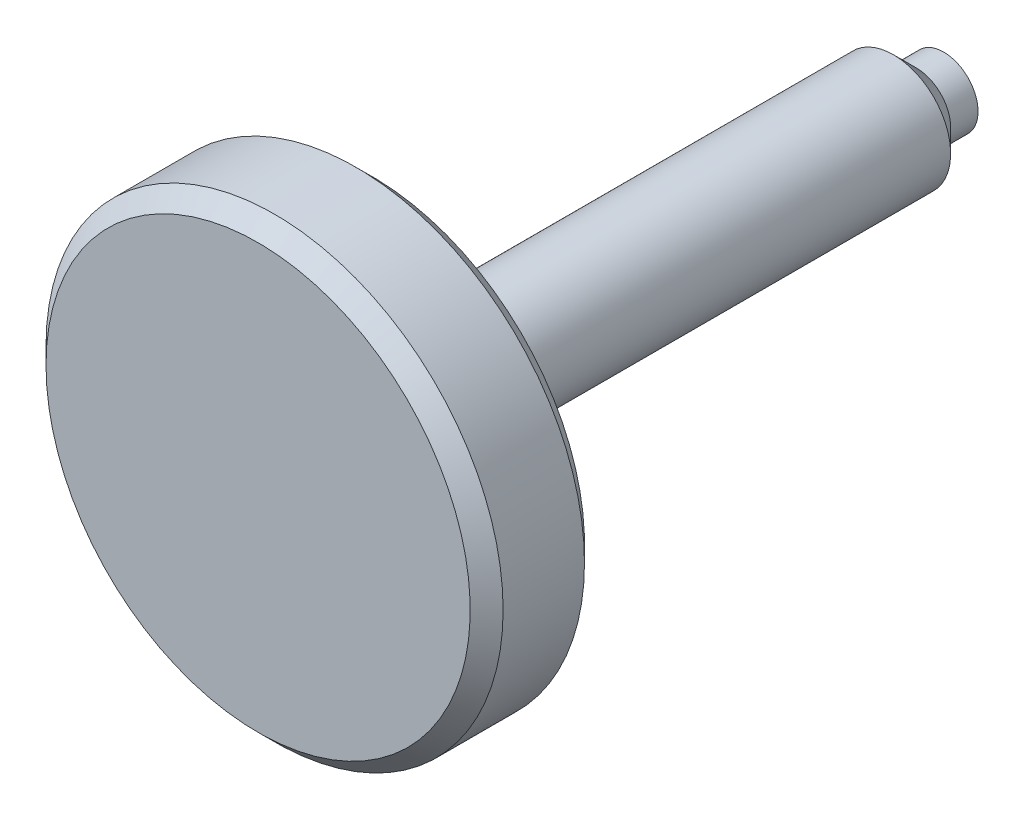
ISO-10303-21;
HEADER;
FILE_DESCRIPTION(('STEP AP214'),'2;1');
FILE_NAME('part.step','',(''),(''),'','','');
FILE_SCHEMA(('AUTOMOTIVE_DESIGN { 1 0 10303 214 1 1 1 1 }'));
ENDSEC;
DATA;
#1=APPLICATION_CONTEXT('core data for automotive mechanical design processes');
#2=APPLICATION_PROTOCOL_DEFINITION('international standard','automotive_design',2000,#1);
#3=PRODUCT_CONTEXT('',#1,'mechanical');
#4=PRODUCT('Part','Part','',(#3));
#5=PRODUCT_RELATED_PRODUCT_CATEGORY('part','',(#4));
#6=PRODUCT_DEFINITION_FORMATION('','',#4);
#7=PRODUCT_DEFINITION_CONTEXT('part definition',#1,'design');
#8=PRODUCT_DEFINITION('design','',#6,#7);
#9=PRODUCT_DEFINITION_SHAPE('','',#8);
#10=(LENGTH_UNIT() NAMED_UNIT(*) SI_UNIT(.MILLI.,.METRE.));
#11=(NAMED_UNIT(*) PLANE_ANGLE_UNIT() SI_UNIT($,.RADIAN.));
#12=(NAMED_UNIT(*) SI_UNIT($,.STERADIAN.) SOLID_ANGLE_UNIT());
#13=UNCERTAINTY_MEASURE_WITH_UNIT(LENGTH_MEASURE(1.E-05),#10,'distance_accuracy_value','');
#14=(GEOMETRIC_REPRESENTATION_CONTEXT(3) GLOBAL_UNCERTAINTY_ASSIGNED_CONTEXT((#13)) GLOBAL_UNIT_ASSIGNED_CONTEXT((#10,
#11,#12)) REPRESENTATION_CONTEXT('',''));
#15=CARTESIAN_POINT('',(0.,0.,0.));
#16=DIRECTION('',(0.,0.,1.));
#17=DIRECTION('',(1.,0.,0.));
#18=AXIS2_PLACEMENT_3D('',#15,#16,#17);
#19=CARTESIAN_POINT('',(0.,-1.5,0.));
#20=DIRECTION('',(0.,0.,-1.));
#21=DIRECTION('',(1.,0.,0.));
#22=AXIS2_PLACEMENT_3D('',#19,#20,#21);
#23=PLANE('',#22);
#24=CARTESIAN_POINT('',(0.,0.,0.));
#25=DIRECTION('',(0.,0.,1.));
#26=DIRECTION('',(-1.,0.,0.));
#27=AXIS2_PLACEMENT_3D('',#24,#25,#26);
#28=CIRCLE('',#27,1.5);
#29=CARTESIAN_POINT('',(-1.5,0.,0.));
#30=VERTEX_POINT('',#29);
#31=EDGE_CURVE('E8',#30,#30,#28,.T.);
#32=ORIENTED_EDGE('',*,*,#31,.F.);
#33=EDGE_LOOP('',(#32));
#34=FACE_BOUND('',#33,.T.);
#35=ADVANCED_FACE('F13',(#34),#23,.T.);
#36=CARTESIAN_POINT('',(0.,0.,41.4535294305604));
#37=DIRECTION('',(0.,0.,1.));
#38=DIRECTION('',(-1.,0.,0.));
#39=AXIS2_PLACEMENT_3D('',#36,#37,#38);
#40=CYLINDRICAL_SURFACE('',#39,1.5);
#41=ORIENTED_EDGE('',*,*,#31,.T.);
#42=EDGE_LOOP('',(#41));
#43=FACE_BOUND('',#42,.T.);
#44=CARTESIAN_POINT('',(0.,0.,1.2));
#45=DIRECTION('',(0.,0.,1.));
#46=DIRECTION('',(-1.,0.,0.));
#47=AXIS2_PLACEMENT_3D('',#44,#45,#46);
#48=CIRCLE('',#47,1.5);
#49=CARTESIAN_POINT('',(-1.5,0.,1.2));
#50=VERTEX_POINT('',#49);
#51=EDGE_CURVE('E21',#50,#50,#48,.T.);
#52=ORIENTED_EDGE('',*,*,#51,.F.);
#53=EDGE_LOOP('',(#52));
#54=FACE_BOUND('',#53,.T.);
#55=ADVANCED_FACE('F150',(#43,#54),#40,.T.);
#56=CARTESIAN_POINT('',(0.,0.,2.20000000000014));
#57=DIRECTION('',(0.,0.,1.));
#58=DIRECTION('',(-1.,0.,0.));
#59=AXIS2_PLACEMENT_3D('',#56,#57,#58);
#60=CONICAL_SURFACE('',#59,2.49999999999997,0.785398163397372);
#61=ORIENTED_EDGE('',*,*,#51,.T.);
#62=EDGE_LOOP('',(#61));
#63=FACE_BOUND('',#62,.T.);
#64=CARTESIAN_POINT('',(0.,0.,2.20000000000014));
#65=DIRECTION('',(0.,0.,1.));
#66=DIRECTION('',(-1.,0.,0.));
#67=AXIS2_PLACEMENT_3D('',#64,#65,#66);
#68=CIRCLE('',#67,2.49999999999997);
#69=CARTESIAN_POINT('',(-2.49999999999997,0.,2.20000000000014));
#70=VERTEX_POINT('',#69);
#71=EDGE_CURVE('E25',#70,#70,#68,.T.);
#72=ORIENTED_EDGE('',*,*,#71,.F.);
#73=EDGE_LOOP('',(#72));
#74=FACE_BOUND('',#73,.T.);
#75=ADVANCED_FACE('F146',(#63,#74),#60,.T.);
#76=CARTESIAN_POINT('',(0.,0.,41.4535294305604));
#77=DIRECTION('',(0.,0.,1.));
#78=DIRECTION('',(-1.,0.,0.));
#79=AXIS2_PLACEMENT_3D('',#76,#77,#78);
#80=CYLINDRICAL_SURFACE('',#79,2.5);
#81=ORIENTED_EDGE('',*,*,#71,.T.);
#82=EDGE_LOOP('',(#81));
#83=FACE_BOUND('',#82,.T.);
#84=CARTESIAN_POINT('',(0.,0.,25.));
#85=DIRECTION('',(0.,0.,1.));
#86=DIRECTION('',(-1.,0.,0.));
#87=AXIS2_PLACEMENT_3D('',#84,#85,#86);
#88=CIRCLE('',#87,2.5);
#89=CARTESIAN_POINT('',(-2.5,0.,25.));
#90=VERTEX_POINT('',#89);
#91=EDGE_CURVE('E29',#90,#90,#88,.T.);
#92=ORIENTED_EDGE('',*,*,#91,.F.);
#93=EDGE_LOOP('',(#92));
#94=FACE_BOUND('',#93,.T.);
#95=ADVANCED_FACE('F142',(#83,#94),#80,.T.);
#96=CARTESIAN_POINT('',(0.,-9.28,25.));
#97=DIRECTION('',(0.,0.,-1.));
#98=DIRECTION('',(1.,0.,0.));
#99=AXIS2_PLACEMENT_3D('',#96,#97,#98);
#100=PLANE('',#99);
#101=ORIENTED_EDGE('',*,*,#91,.T.);
#102=EDGE_LOOP('',(#101));
#103=FACE_BOUND('',#102,.T.);
#104=CARTESIAN_POINT('',(0.,0.,25.));
#105=DIRECTION('',(0.,0.,1.));
#106=DIRECTION('',(-1.,0.,0.));
#107=AXIS2_PLACEMENT_3D('',#104,#105,#106);
#108=CIRCLE('',#107,9.28);
#109=CARTESIAN_POINT('',(-9.28,0.,25.));
#110=VERTEX_POINT('',#109);
#111=EDGE_CURVE('E34',#110,#110,#108,.T.);
#112=ORIENTED_EDGE('',*,*,#111,.F.);
#113=EDGE_LOOP('',(#112));
#114=FACE_BOUND('',#113,.T.);
#115=ADVANCED_FACE('F138',(#103,#114),#100,.T.);
#116=CARTESIAN_POINT('',(0.,0.,25.72));
#117=DIRECTION('',(0.,0.,1.));
#118=DIRECTION('',(-1.,0.,0.));
#119=AXIS2_PLACEMENT_3D('',#116,#117,#118);
#120=CONICAL_SURFACE('',#119,10.,0.785398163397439);
#121=ORIENTED_EDGE('',*,*,#111,.T.);
#122=EDGE_LOOP('',(#121));
#123=FACE_BOUND('',#122,.T.);
#124=CARTESIAN_POINT('',(0.,0.,25.72));
#125=DIRECTION('',(0.,0.,1.));
#126=DIRECTION('',(-1.,0.,0.));
#127=AXIS2_PLACEMENT_3D('',#124,#125,#126);
#128=CIRCLE('',#127,10.);
#129=CARTESIAN_POINT('',(-10.,0.,25.72));
#130=VERTEX_POINT('',#129);
#131=EDGE_CURVE('E37',#130,#130,#128,.T.);
#132=ORIENTED_EDGE('',*,*,#131,.F.);
#133=EDGE_LOOP('',(#132));
#134=FACE_BOUND('',#133,.T.);
#135=ADVANCED_FACE('F134',(#123,#134),#120,.T.);
#136=CARTESIAN_POINT('',(0.,0.,41.4535294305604));
#137=DIRECTION('',(0.,0.,1.));
#138=DIRECTION('',(-1.,0.,0.));
#139=AXIS2_PLACEMENT_3D('',#136,#137,#138);
#140=CYLINDRICAL_SURFACE('',#139,10.);
#141=ORIENTED_EDGE('',*,*,#131,.T.);
#142=EDGE_LOOP('',(#141));
#143=FACE_BOUND('',#142,.T.);
#144=CARTESIAN_POINT('',(0.,0.,29.28));
#145=DIRECTION('',(0.,0.,1.));
#146=DIRECTION('',(-1.,0.,0.));
#147=AXIS2_PLACEMENT_3D('',#144,#145,#146);
#148=CIRCLE('',#147,10.);
#149=CARTESIAN_POINT('',(-10.,0.,29.28));
#150=VERTEX_POINT('',#149);
#151=EDGE_CURVE('E40',#150,#150,#148,.T.);
#152=ORIENTED_EDGE('',*,*,#151,.F.);
#153=EDGE_LOOP('',(#152));
#154=FACE_BOUND('',#153,.T.);
#155=ADVANCED_FACE('F130',(#143,#154),#140,.T.);
#156=CARTESIAN_POINT('',(0.,0.,30.));
#157=DIRECTION('',(0.,0.,-1.));
#158=DIRECTION('',(1.,0.,0.));
#159=AXIS2_PLACEMENT_3D('',#156,#157,#158);
#160=CONICAL_SURFACE('',#159,9.28,0.785398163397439);
#161=ORIENTED_EDGE('',*,*,#151,.T.);
#162=EDGE_LOOP('',(#161));
#163=FACE_BOUND('',#162,.T.);
#164=CARTESIAN_POINT('',(0.,0.,30.));
#165=DIRECTION('',(0.,0.,1.));
#166=DIRECTION('',(-1.,0.,0.));
#167=AXIS2_PLACEMENT_3D('',#164,#165,#166);
#168=CIRCLE('',#167,9.28);
#169=CARTESIAN_POINT('',(-9.28,0.,30.));
#170=VERTEX_POINT('',#169);
#171=EDGE_CURVE('E43',#170,#170,#168,.T.);
#172=ORIENTED_EDGE('',*,*,#171,.F.);
#173=EDGE_LOOP('',(#172));
#174=FACE_BOUND('',#173,.T.);
#175=ADVANCED_FACE('F126',(#163,#174),#160,.T.);
#176=CARTESIAN_POINT('',(0.,0.,30.));
#177=DIRECTION('',(0.,0.,1.));
#178=DIRECTION('',(-1.,0.,0.));
#179=AXIS2_PLACEMENT_3D('',#176,#177,#178);
#180=PLANE('',#179);
#181=ORIENTED_EDGE('',*,*,#171,.T.);
#182=EDGE_LOOP('',(#181));
#183=FACE_BOUND('',#182,.T.);
#184=ADVANCED_FACE('F123',(#183),#180,.T.);
#185=CLOSED_SHELL('',(#35,#55,#75,#95,#115,#135,#155,#175,#184));
#186=CARTESIAN_POINT('',(0.,-1.5,1.));
#187=DIRECTION('',(0.,0.,-1.));
#188=DIRECTION('',(1.,0.,0.));
#189=AXIS2_PLACEMENT_3D('',#186,#187,#188);
#190=PLANE('',#189);
#191=CARTESIAN_POINT('',(0.,0.,1.));
#192=DIRECTION('',(0.,0.,1.));
#193=DIRECTION('',(-1.,0.,0.));
#194=AXIS2_PLACEMENT_3D('',#191,#192,#193);
#195=CIRCLE('',#194,0.5);
#196=CARTESIAN_POINT('',(-0.5,0.,1.));
#197=VERTEX_POINT('',#196);
#198=EDGE_CURVE('E67',#197,#197,#195,.T.);
#199=ORIENTED_EDGE('',*,*,#198,.T.);
#200=EDGE_LOOP('',(#199));
#201=FACE_BOUND('',#200,.T.);
#202=ADVANCED_FACE('F15',(#201),#190,.F.);
#203=CARTESIAN_POINT('',(0.,0.,29.));
#204=DIRECTION('',(0.,0.,1.));
#205=DIRECTION('',(-1.,0.,0.));
#206=AXIS2_PLACEMENT_3D('',#203,#204,#205);
#207=PLANE('',#206);
#208=CARTESIAN_POINT('',(0.,0.,29.));
#209=DIRECTION('',(0.,0.,1.));
#210=DIRECTION('',(-1.,0.,0.));
#211=AXIS2_PLACEMENT_3D('',#208,#209,#210);
#212=CIRCLE('',#211,8.86578643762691);
#213=CARTESIAN_POINT('',(-8.86578643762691,0.,29.));
#214=VERTEX_POINT('',#213);
#215=EDGE_CURVE('E46',#214,#214,#212,.T.);
#216=ORIENTED_EDGE('',*,*,#215,.F.);
#217=EDGE_LOOP('',(#216));
#218=FACE_BOUND('',#217,.T.);
#219=ADVANCED_FACE('F112',(#218),#207,.F.);
#220=CARTESIAN_POINT('',(0.,0.,29.));
#221=DIRECTION('',(0.,0.,-1.));
#222=DIRECTION('',(1.,0.,0.));
#223=AXIS2_PLACEMENT_3D('',#220,#221,#222);
#224=CONICAL_SURFACE('',#223,8.86578643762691,0.785398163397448);
#225=CARTESIAN_POINT('',(0.,0.,28.8657864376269));
#226=DIRECTION('',(0.,0.,1.));
#227=DIRECTION('',(-1.,0.,0.));
#228=AXIS2_PLACEMENT_3D('',#225,#226,#227);
#229=CIRCLE('',#228,9.);
#230=CARTESIAN_POINT('',(-9.,0.,28.8657864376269));
#231=VERTEX_POINT('',#230);
#232=EDGE_CURVE('E49',#231,#231,#229,.T.);
#233=ORIENTED_EDGE('',*,*,#232,.F.);
#234=EDGE_LOOP('',(#233));
#235=FACE_BOUND('',#234,.T.);
#236=ORIENTED_EDGE('',*,*,#215,.T.);
#237=EDGE_LOOP('',(#236));
#238=FACE_BOUND('',#237,.T.);
#239=ADVANCED_FACE('F106',(#235,#238),#224,.F.);
#240=CARTESIAN_POINT('',(0.,0.,41.4535294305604));
#241=DIRECTION('',(0.,0.,1.));
#242=DIRECTION('',(-1.,0.,0.));
#243=AXIS2_PLACEMENT_3D('',#240,#241,#242);
#244=CYLINDRICAL_SURFACE('',#243,9.);
#245=CARTESIAN_POINT('',(0.,0.,26.1342135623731));
#246=DIRECTION('',(0.,0.,1.));
#247=DIRECTION('',(-1.,0.,0.));
#248=AXIS2_PLACEMENT_3D('',#245,#246,#247);
#249=CIRCLE('',#248,9.);
#250=CARTESIAN_POINT('',(-9.,0.,26.1342135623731));
#251=VERTEX_POINT('',#250);
#252=EDGE_CURVE('E52',#251,#251,#249,.T.);
#253=ORIENTED_EDGE('',*,*,#252,.F.);
#254=EDGE_LOOP('',(#253));
#255=FACE_BOUND('',#254,.T.);
#256=ORIENTED_EDGE('',*,*,#232,.T.);
#257=EDGE_LOOP('',(#256));
#258=FACE_BOUND('',#257,.T.);
#259=ADVANCED_FACE('F100',(#255,#258),#244,.F.);
#260=CARTESIAN_POINT('',(0.,0.,26.1342135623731));
#261=DIRECTION('',(0.,0.,1.));
#262=DIRECTION('',(-1.,0.,0.));
#263=AXIS2_PLACEMENT_3D('',#260,#261,#262);
#264=CONICAL_SURFACE('',#263,9.,0.785398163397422);
#265=CARTESIAN_POINT('',(0.,0.,26.));
#266=DIRECTION('',(0.,0.,1.));
#267=DIRECTION('',(-1.,0.,0.));
#268=AXIS2_PLACEMENT_3D('',#265,#266,#267);
#269=CIRCLE('',#268,8.86578643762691);
#270=CARTESIAN_POINT('',(-8.86578643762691,0.,26.));
#271=VERTEX_POINT('',#270);
#272=EDGE_CURVE('E55',#271,#271,#269,.T.);
#273=ORIENTED_EDGE('',*,*,#272,.F.);
#274=EDGE_LOOP('',(#273));
#275=FACE_BOUND('',#274,.T.);
#276=ORIENTED_EDGE('',*,*,#252,.T.);
#277=EDGE_LOOP('',(#276));
#278=FACE_BOUND('',#277,.T.);
#279=ADVANCED_FACE('F94',(#275,#278),#264,.F.);
#280=CARTESIAN_POINT('',(0.,-9.28,26.));
#281=DIRECTION('',(0.,0.,-1.));
#282=DIRECTION('',(1.,0.,0.));
#283=AXIS2_PLACEMENT_3D('',#280,#281,#282);
#284=PLANE('',#283);
#285=CARTESIAN_POINT('',(0.,0.,26.));
#286=DIRECTION('',(0.,0.,1.));
#287=DIRECTION('',(-1.,0.,0.));
#288=AXIS2_PLACEMENT_3D('',#285,#286,#287);
#289=CIRCLE('',#288,1.5);
#290=CARTESIAN_POINT('',(-1.5,0.,26.));
#291=VERTEX_POINT('',#290);
#292=EDGE_CURVE('E58',#291,#291,#289,.T.);
#293=ORIENTED_EDGE('',*,*,#292,.F.);
#294=EDGE_LOOP('',(#293));
#295=FACE_BOUND('',#294,.T.);
#296=ORIENTED_EDGE('',*,*,#272,.T.);
#297=EDGE_LOOP('',(#296));
#298=FACE_BOUND('',#297,.T.);
#299=ADVANCED_FACE('F88',(#295,#298),#284,.F.);
#300=CARTESIAN_POINT('',(0.,0.,41.4535294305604));
#301=DIRECTION('',(0.,0.,1.));
#302=DIRECTION('',(-1.,0.,0.));
#303=AXIS2_PLACEMENT_3D('',#300,#301,#302);
#304=CYLINDRICAL_SURFACE('',#303,1.49999999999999);
#305=CARTESIAN_POINT('',(0.,0.,2.61421356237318));
#306=DIRECTION('',(0.,0.,1.));
#307=DIRECTION('',(-1.,0.,0.));
#308=AXIS2_PLACEMENT_3D('',#305,#306,#307);
#309=CIRCLE('',#308,1.49999999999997);
#310=CARTESIAN_POINT('',(-1.49999999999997,0.,2.61421356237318));
#311=VERTEX_POINT('',#310);
#312=EDGE_CURVE('E61',#311,#311,#309,.T.);
#313=ORIENTED_EDGE('',*,*,#312,.F.);
#314=EDGE_LOOP('',(#313));
#315=FACE_BOUND('',#314,.T.);
#316=ORIENTED_EDGE('',*,*,#292,.T.);
#317=EDGE_LOOP('',(#316));
#318=FACE_BOUND('',#317,.T.);
#319=ADVANCED_FACE('F82',(#315,#318),#304,.F.);
#320=CARTESIAN_POINT('',(0.,0.,2.61421356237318));
#321=DIRECTION('',(0.,0.,1.));
#322=DIRECTION('',(-1.,0.,0.));
#323=AXIS2_PLACEMENT_3D('',#320,#321,#322);
#324=CONICAL_SURFACE('',#323,1.49999999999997,0.785398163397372);
#325=CARTESIAN_POINT('',(0.,0.,1.61421356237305));
#326=DIRECTION('',(0.,0.,1.));
#327=DIRECTION('',(-1.,0.,0.));
#328=AXIS2_PLACEMENT_3D('',#325,#326,#327);
#329=CIRCLE('',#328,0.5);
#330=CARTESIAN_POINT('',(-0.500000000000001,0.,1.61421356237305));
#331=VERTEX_POINT('',#330);
#332=EDGE_CURVE('E64',#331,#331,#329,.T.);
#333=CARTESIAN_POINT('',(-0.500000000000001,0.,1.61421356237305));
#334=CARTESIAN_POINT('',(-0.510416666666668,0.,1.62463022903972));
#335=CARTESIAN_POINT('',(-0.520833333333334,0.,1.63504689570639));
#336=CARTESIAN_POINT('',(-0.541666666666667,0.,1.65588022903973));
#337=CARTESIAN_POINT('',(-0.552083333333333,0.,1.6662968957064));
#338=CARTESIAN_POINT('',(-0.572916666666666,0.,1.68713022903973));
#339=CARTESIAN_POINT('',(-0.583333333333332,0.,1.6975468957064));
#340=CARTESIAN_POINT('',(-0.604166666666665,0.,1.71838022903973));
#341=CARTESIAN_POINT('',(-0.614583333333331,0.,1.7287968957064));
#342=CARTESIAN_POINT('',(-0.635416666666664,0.,1.74963022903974));
#343=CARTESIAN_POINT('',(-0.645833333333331,0.,1.76004689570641));
#344=CARTESIAN_POINT('',(-0.666666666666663,0.,1.78088022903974));
#345=CARTESIAN_POINT('',(-0.67708333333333,0.,1.79129689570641));
#346=CARTESIAN_POINT('',(-0.697916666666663,0.,1.81213022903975));
#347=CARTESIAN_POINT('',(-0.708333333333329,0.,1.82254689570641));
#348=CARTESIAN_POINT('',(-0.729166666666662,0.,1.84338022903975));
#349=CARTESIAN_POINT('',(-0.739583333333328,0.,1.85379689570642));
#350=CARTESIAN_POINT('',(-0.760416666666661,0.,1.87463022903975));
#351=CARTESIAN_POINT('',(-0.770833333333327,0.,1.88504689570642));
#352=CARTESIAN_POINT('',(-0.79166666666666,0.,1.90588022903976));
#353=CARTESIAN_POINT('',(-0.802083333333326,0.,1.91629689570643));
#354=CARTESIAN_POINT('',(-0.822916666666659,0.,1.93713022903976));
#355=CARTESIAN_POINT('',(-0.833333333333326,0.,1.94754689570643));
#356=CARTESIAN_POINT('',(-0.854166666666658,0.,1.96838022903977));
#357=CARTESIAN_POINT('',(-0.864583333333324,0.,1.97879689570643));
#358=CARTESIAN_POINT('',(-0.885416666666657,0.,1.99963022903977));
#359=CARTESIAN_POINT('',(-0.895833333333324,0.,2.01004689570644));
#360=CARTESIAN_POINT('',(-0.916666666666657,0.,2.03088022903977));
#361=CARTESIAN_POINT('',(-0.927083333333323,0.,2.04129689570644));
#362=CARTESIAN_POINT('',(-0.947916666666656,0.,2.06213022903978));
#363=CARTESIAN_POINT('',(-0.958333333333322,0.,2.07254689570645));
#364=CARTESIAN_POINT('',(-0.979166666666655,0.,2.09338022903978));
#365=CARTESIAN_POINT('',(-0.989583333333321,0.,2.10379689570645));
#366=CARTESIAN_POINT('',(-1.01041666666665,0.,2.12463022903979));
#367=CARTESIAN_POINT('',(-1.02083333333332,0.,2.13504689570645));
#368=CARTESIAN_POINT('',(-1.04166666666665,0.,2.15588022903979));
#369=CARTESIAN_POINT('',(-1.05208333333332,0.,2.16629689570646));
#370=CARTESIAN_POINT('',(-1.07291666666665,0.,2.18713022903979));
#371=CARTESIAN_POINT('',(-1.08333333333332,0.,2.19754689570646));
#372=CARTESIAN_POINT('',(-1.10416666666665,0.,2.2183802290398));
#373=CARTESIAN_POINT('',(-1.11458333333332,0.,2.22879689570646));
#374=CARTESIAN_POINT('',(-1.13541666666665,0.,2.2496302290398));
#375=CARTESIAN_POINT('',(-1.14583333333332,0.,2.26004689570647));
#376=CARTESIAN_POINT('',(-1.16666666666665,0.,2.28088022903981));
#377=CARTESIAN_POINT('',(-1.17708333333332,0.,2.29129689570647));
#378=CARTESIAN_POINT('',(-1.19791666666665,0.,2.31213022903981));
#379=CARTESIAN_POINT('',(-1.20833333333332,0.,2.32254689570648));
#380=CARTESIAN_POINT('',(-1.22916666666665,0.,2.34338022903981));
#381=CARTESIAN_POINT('',(-1.23958333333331,0.,2.35379689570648));
#382=CARTESIAN_POINT('',(-1.26041666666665,0.,2.37463022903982));
#383=CARTESIAN_POINT('',(-1.27083333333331,0.,2.38504689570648));
#384=CARTESIAN_POINT('',(-1.29166666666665,0.,2.40588022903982));
#385=CARTESIAN_POINT('',(-1.30208333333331,0.,2.41629689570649));
#386=CARTESIAN_POINT('',(-1.32291666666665,0.,2.43713022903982));
#387=CARTESIAN_POINT('',(-1.33333333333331,0.,2.44754689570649));
#388=CARTESIAN_POINT('',(-1.35416666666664,0.,2.46838022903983));
#389=CARTESIAN_POINT('',(-1.36458333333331,0.,2.4787968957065));
#390=CARTESIAN_POINT('',(-1.38541666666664,0.,2.49963022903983));
#391=CARTESIAN_POINT('',(-1.39583333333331,0.,2.5100468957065));
#392=CARTESIAN_POINT('',(-1.41666666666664,0.,2.53088022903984));
#393=CARTESIAN_POINT('',(-1.42708333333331,0.,2.5412968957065));
#394=CARTESIAN_POINT('',(-1.44791666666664,0.,2.56213022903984));
#395=CARTESIAN_POINT('',(-1.45833333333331,0.,2.57254689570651));
#396=CARTESIAN_POINT('',(-1.47916666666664,0.,2.59338022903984));
#397=CARTESIAN_POINT('',(-1.48958333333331,0.,2.60379689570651));
#398=CARTESIAN_POINT('',(-1.49999999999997,0.,2.61421356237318));
#399=B_SPLINE_CURVE_WITH_KNOTS('',3,(#333,#334,#335,#336,#337,#338,#339,#340,#341,#342,#343,
#344,#345,#346,#347,#348,#349,#350,#351,#352,#353,#354,#355,#356,#357,#358,#359,#360,#361,#362,
#363,#364,#365,#366,#367,#368,#369,#370,#371,#372,#373,#374,#375,#376,#377,#378,#379,#380,#381,
#382,#383,#384,#385,#386,#387,#388,#389,#390,#391,#392,#393,#394,#395,#396,#397,#398),
.UNSPECIFIED.,.F.,.F.,(4,2,2,2,2,2,2,2,2,2,2,2,2,2,2,2,2,2,2,2,2,2,2,2,2,2,2,2,2,2,2,2,4),(0.,
0.0441941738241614,0.0883883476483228,0.132582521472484,0.176776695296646,0.220970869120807,
0.265165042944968,0.30935921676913,0.353553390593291,0.397747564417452,0.441941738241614,
0.486135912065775,0.530330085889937,0.574524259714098,0.618718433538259,0.66291260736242,
0.707106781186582,0.751300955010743,0.795495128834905,0.839689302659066,0.883883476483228,
0.928077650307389,0.97227182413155,1.01646599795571,1.06066017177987,1.10485434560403,
1.1490485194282,1.19324269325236,1.23743686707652,1.28163104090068,1.32582521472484,
1.370019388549,1.41421356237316),.UNSPECIFIED.);
#400=EDGE_CURVE('BSEAM75',#331,#311,#399,.T.);
#401=ORIENTED_EDGE('',*,*,#332,.F.);
#402=ORIENTED_EDGE('',*,*,#312,.T.);
#403=ORIENTED_EDGE('',*,*,#400,.T.);
#404=ORIENTED_EDGE('',*,*,#400,.F.);
#405=EDGE_LOOP('',(#401,#403,#402,#404));
#406=FACE_BOUND('',#405,.T.);
#407=ADVANCED_FACE('F75',(#406),#324,.F.);
#408=CARTESIAN_POINT('',(0.,0.,41.4535294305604));
#409=DIRECTION('',(0.,0.,1.));
#410=DIRECTION('',(-1.,0.,0.));
#411=AXIS2_PLACEMENT_3D('',#408,#409,#410);
#412=CYLINDRICAL_SURFACE('',#411,0.5);
#413=ORIENTED_EDGE('',*,*,#198,.F.);
#414=EDGE_LOOP('',(#413));
#415=FACE_BOUND('',#414,.T.);
#416=ORIENTED_EDGE('',*,*,#332,.T.);
#417=EDGE_LOOP('',(#416));
#418=FACE_BOUND('',#417,.T.);
#419=ADVANCED_FACE('F72',(#415,#418),#412,.F.);
#420=CLOSED_SHELL('',(#202,#219,#239,#259,#279,#299,#319,#407,#419));
#421=ORIENTED_CLOSED_SHELL('',*,#420,.T.);
#422=BREP_WITH_VOIDS('B1',#185,(#421));
#423=ADVANCED_BREP_SHAPE_REPRESENTATION('',(#18,#422),#14);
#424=SHAPE_DEFINITION_REPRESENTATION(#9,#423);
ENDSEC;
END-ISO-10303-21;
